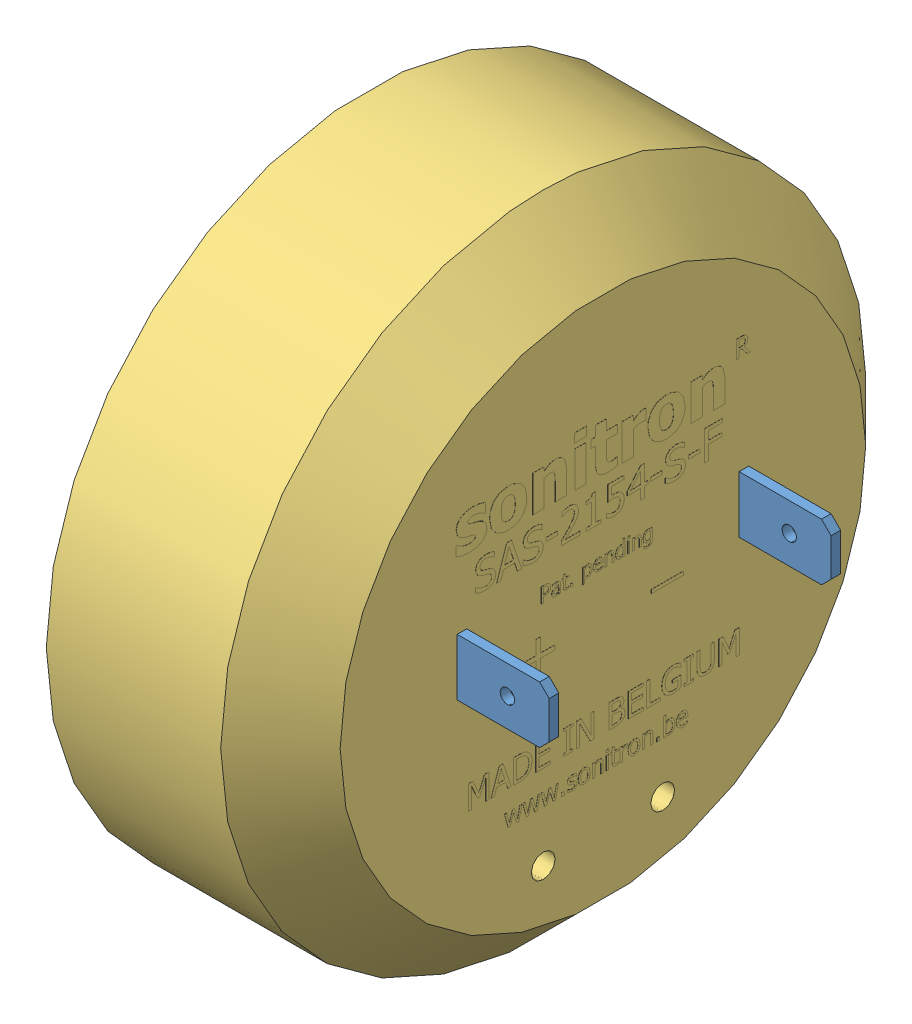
SolidWorks assembly Sonitron-SAS-2154-S-F.sldasm, configuration Default (file format 12000). Lengths in mm.
Overall size (27.3 54 54).
4 component instances, 3 part files, 0 mates.
Components (placement in the parent):
- Sonitron-SAS-2154-S-F_Fast-on 2-1: Sonitron-SAS-2154-S-F_Fast-on 2.sldprt [Default] at (-6.1385 -17.3613 -12.2) size (8.7 4.76 0.8)
- Sonitron-SAS-2154-S-F_Fast-on 2-2: Sonitron-SAS-2154-S-F_Fast-on 2.sldprt [Default] at (-6.1385 -17.3613 11.4) size (8.7 4.76 0.8)
- Sonitron-SAS-2154-S-F_Unimorf1-1: Sonitron-SAS-2154-S-F_Unimorf1.sldprt [Default] at (-13 -8.7832 0) x (0 0 -1) z (1 0 0) size (48 48 0.1)
- Sonitron-SAS-2154-S-F_HousingF1-1: Sonitron-SAS-2154-S-F_HousingF1.sldprt [Default] at origin size (19.61 54 54)
